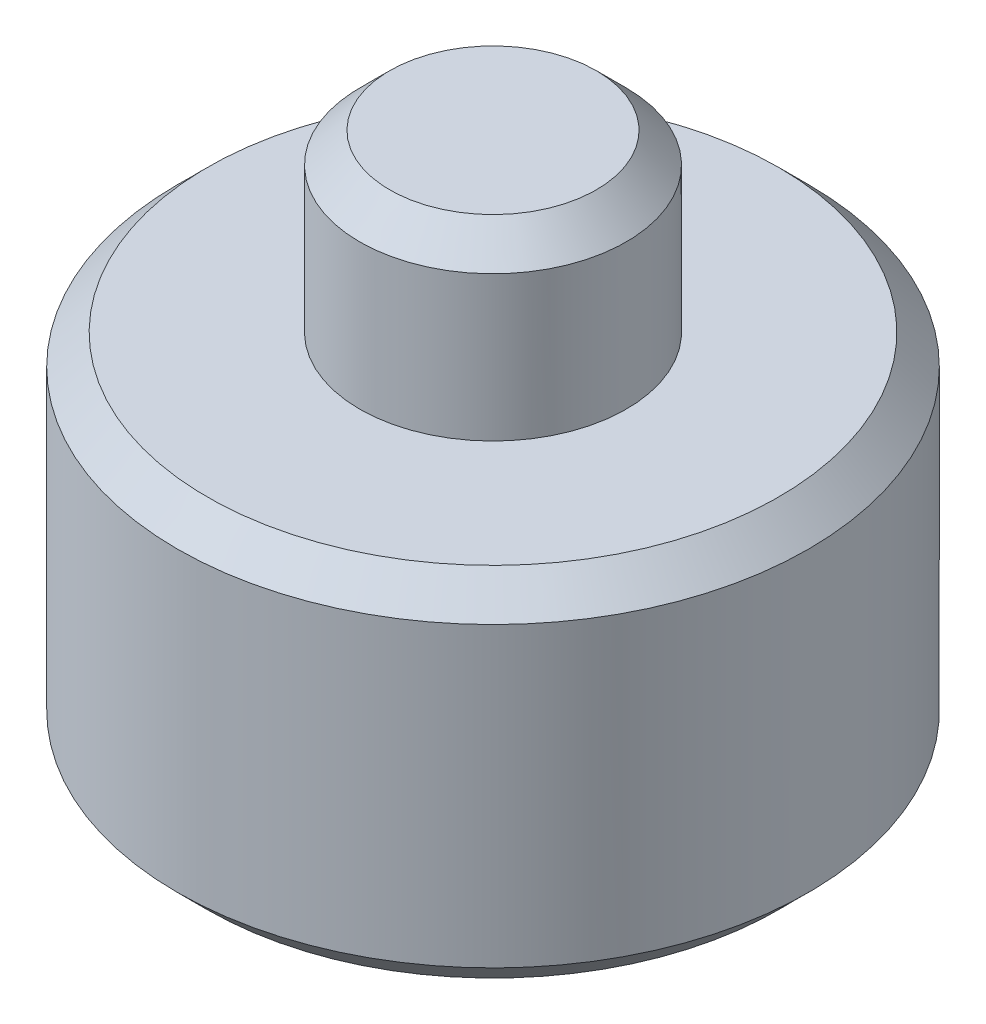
ISO-10303-21;
HEADER;
FILE_DESCRIPTION(('STEP AP214'),'2;1');
FILE_NAME('part.step','',(''),(''),'','','');
FILE_SCHEMA(('AUTOMOTIVE_DESIGN { 1 0 10303 214 1 1 1 1 }'));
ENDSEC;
DATA;
#1=APPLICATION_CONTEXT('core data for automotive mechanical design processes');
#2=APPLICATION_PROTOCOL_DEFINITION('international standard','automotive_design',2000,#1);
#3=PRODUCT_CONTEXT('',#1,'mechanical');
#4=PRODUCT('Part','Part','',(#3));
#5=PRODUCT_RELATED_PRODUCT_CATEGORY('part','',(#4));
#6=PRODUCT_DEFINITION_FORMATION('','',#4);
#7=PRODUCT_DEFINITION_CONTEXT('part definition',#1,'design');
#8=PRODUCT_DEFINITION('design','',#6,#7);
#9=PRODUCT_DEFINITION_SHAPE('','',#8);
#10=(LENGTH_UNIT() NAMED_UNIT(*) SI_UNIT(.MILLI.,.METRE.));
#11=(NAMED_UNIT(*) PLANE_ANGLE_UNIT() SI_UNIT($,.RADIAN.));
#12=(NAMED_UNIT(*) SI_UNIT($,.STERADIAN.) SOLID_ANGLE_UNIT());
#13=UNCERTAINTY_MEASURE_WITH_UNIT(LENGTH_MEASURE(1.E-05),#10,'distance_accuracy_value','');
#14=(GEOMETRIC_REPRESENTATION_CONTEXT(3) GLOBAL_UNCERTAINTY_ASSIGNED_CONTEXT((#13)) GLOBAL_UNIT_ASSIGNED_CONTEXT((#10,
#11,#12)) REPRESENTATION_CONTEXT('',''));
#15=CARTESIAN_POINT('',(0.,0.,0.));
#16=DIRECTION('',(0.,0.,1.));
#17=DIRECTION('',(1.,0.,0.));
#18=AXIS2_PLACEMENT_3D('',#15,#16,#17);
#19=CARTESIAN_POINT('',(0.,-5.,0.));
#20=DIRECTION('',(0.,1.,0.));
#21=DIRECTION('',(0.,0.,1.));
#22=AXIS2_PLACEMENT_3D('',#19,#20,#21);
#23=PLANE('',#22);
#24=CARTESIAN_POINT('',(0.,-5.,0.));
#25=DIRECTION('',(0.,1.,0.));
#26=DIRECTION('',(0.,0.,1.));
#27=AXIS2_PLACEMENT_3D('',#24,#25,#26);
#28=CIRCLE('',#27,28.538879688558);
#29=CARTESIAN_POINT('',(0.,-5.,28.538879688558));
#30=VERTEX_POINT('',#29);
#31=EDGE_CURVE('E47',#30,#30,#28,.F.);
#32=ORIENTED_EDGE('',*,*,#31,.T.);
#33=EDGE_LOOP('',(#32));
#34=FACE_BOUND('',#33,.T.);
#35=ADVANCED_FACE('F32',(#34),#23,.F.);
#36=CARTESIAN_POINT('',(0.,48.1925520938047,0.));
#37=DIRECTION('',(0.,1.,0.));
#38=DIRECTION('',(0.,0.,1.));
#39=AXIS2_PLACEMENT_3D('',#36,#37,#38);
#40=CYLINDRICAL_SURFACE('',#39,31.538879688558);
#41=CARTESIAN_POINT('',(0.,-1.99999999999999,0.));
#42=DIRECTION('',(0.,1.,0.));
#43=DIRECTION('',(0.,0.,1.));
#44=AXIS2_PLACEMENT_3D('',#41,#42,#43);
#45=CIRCLE('',#44,31.538879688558);
#46=CARTESIAN_POINT('',(0.,-1.99999999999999,31.538879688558));
#47=VERTEX_POINT('',#46);
#48=EDGE_CURVE('E52',#47,#47,#45,.T.);
#49=ORIENTED_EDGE('',*,*,#48,.T.);
#50=EDGE_LOOP('',(#49));
#51=FACE_BOUND('',#50,.T.);
#52=CARTESIAN_POINT('',(0.,27.7156214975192,0.));
#53=DIRECTION('',(0.,-1.,0.));
#54=DIRECTION('',(0.,0.,-1.));
#55=AXIS2_PLACEMENT_3D('',#52,#53,#54);
#56=CIRCLE('',#55,31.538879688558);
#57=CARTESIAN_POINT('',(0.,27.7156214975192,-31.538879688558));
#58=VERTEX_POINT('',#57);
#59=EDGE_CURVE('E55',#58,#58,#56,.T.);
#60=ORIENTED_EDGE('',*,*,#59,.T.);
#61=EDGE_LOOP('',(#60));
#62=FACE_BOUND('',#61,.T.);
#63=ADVANCED_FACE('F66',(#51,#62),#40,.T.);
#64=CARTESIAN_POINT('',(21.538879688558,30.7156214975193,0.));
#65=DIRECTION('',(0.,-1.,0.));
#66=DIRECTION('',(0.,0.,-1.));
#67=AXIS2_PLACEMENT_3D('',#64,#65,#66);
#68=PLANE('',#67);
#69=CARTESIAN_POINT('',(0.,30.7156214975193,0.));
#70=DIRECTION('',(0.,-1.,0.));
#71=DIRECTION('',(0.,0.,-1.));
#72=AXIS2_PLACEMENT_3D('',#69,#70,#71);
#73=CIRCLE('',#72,28.538879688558);
#74=CARTESIAN_POINT('',(0.,30.7156214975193,-28.538879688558));
#75=VERTEX_POINT('',#74);
#76=EDGE_CURVE('E43',#75,#75,#73,.F.);
#77=ORIENTED_EDGE('',*,*,#76,.T.);
#78=EDGE_LOOP('',(#77));
#79=FACE_BOUND('',#78,.T.);
#80=CARTESIAN_POINT('',(0.,30.7156214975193,0.));
#81=DIRECTION('',(0.,1.,0.));
#82=DIRECTION('',(0.,0.,1.));
#83=AXIS2_PLACEMENT_3D('',#80,#81,#82);
#84=CIRCLE('',#83,13.323228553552);
#85=CARTESIAN_POINT('',(0.,30.7156214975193,13.323228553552));
#86=VERTEX_POINT('',#85);
#87=EDGE_CURVE('E58',#86,#86,#84,.T.);
#88=ORIENTED_EDGE('',*,*,#87,.F.);
#89=EDGE_LOOP('',(#88));
#90=FACE_BOUND('',#89,.T.);
#91=ADVANCED_FACE('F64',(#79,#90),#68,.F.);
#92=CARTESIAN_POINT('',(0.,48.1925520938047,0.));
#93=DIRECTION('',(0.,1.,0.));
#94=DIRECTION('',(0.,0.,1.));
#95=AXIS2_PLACEMENT_3D('',#92,#93,#94);
#96=CYLINDRICAL_SURFACE('',#95,13.323228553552);
#97=CARTESIAN_POINT('',(0.,45.1925520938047,0.));
#98=DIRECTION('',(0.,-1.,0.));
#99=DIRECTION('',(0.,0.,-1.));
#100=AXIS2_PLACEMENT_3D('',#97,#98,#99);
#101=CIRCLE('',#100,13.323228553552);
#102=CARTESIAN_POINT('',(0.,45.1925520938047,-13.323228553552));
#103=VERTEX_POINT('',#102);
#104=EDGE_CURVE('E11',#103,#103,#101,.T.);
#105=ORIENTED_EDGE('',*,*,#104,.T.);
#106=EDGE_LOOP('',(#105));
#107=FACE_BOUND('',#106,.T.);
#108=ORIENTED_EDGE('',*,*,#87,.T.);
#109=EDGE_LOOP('',(#108));
#110=FACE_BOUND('',#109,.T.);
#111=ADVANCED_FACE('F62',(#107,#110),#96,.T.);
#112=CARTESIAN_POINT('',(13.323228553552,48.1925520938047,0.));
#113=DIRECTION('',(0.,-1.,0.));
#114=DIRECTION('',(0.,0.,-1.));
#115=AXIS2_PLACEMENT_3D('',#112,#113,#114);
#116=PLANE('',#115);
#117=CARTESIAN_POINT('',(0.,48.1925520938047,0.));
#118=DIRECTION('',(0.,-1.,0.));
#119=DIRECTION('',(0.,0.,-1.));
#120=AXIS2_PLACEMENT_3D('',#117,#118,#119);
#121=CIRCLE('',#120,10.323228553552);
#122=CARTESIAN_POINT('',(0.,48.1925520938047,-10.323228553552));
#123=VERTEX_POINT('',#122);
#124=EDGE_CURVE('E39',#123,#123,#121,.F.);
#125=ORIENTED_EDGE('',*,*,#124,.T.);
#126=EDGE_LOOP('',(#125));
#127=FACE_BOUND('',#126,.T.);
#128=ADVANCED_FACE('F73',(#127),#116,.F.);
#129=CARTESIAN_POINT('',(0.,-1.99999999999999,0.));
#130=DIRECTION('',(0.,1.,0.));
#131=DIRECTION('',(0.,0.,1.));
#132=AXIS2_PLACEMENT_3D('',#129,#130,#131);
#133=CONICAL_SURFACE('',#132,31.538879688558,0.785398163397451);
#134=ORIENTED_EDGE('',*,*,#31,.F.);
#135=EDGE_LOOP('',(#134));
#136=FACE_BOUND('',#135,.T.);
#137=ORIENTED_EDGE('',*,*,#48,.F.);
#138=EDGE_LOOP('',(#137));
#139=FACE_BOUND('',#138,.T.);
#140=ADVANCED_FACE('F83',(#136,#139),#133,.T.);
#141=CARTESIAN_POINT('',(0.,30.7156214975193,0.));
#142=DIRECTION('',(0.,-1.,0.));
#143=DIRECTION('',(0.,0.,-1.));
#144=AXIS2_PLACEMENT_3D('',#141,#142,#143);
#145=CONICAL_SURFACE('',#144,28.538879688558,0.785398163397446);
#146=CARTESIAN_POINT('',(0.,27.7156214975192,-31.538879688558));
#147=CARTESIAN_POINT('',(0.,27.7468714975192,-31.507629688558));
#148=CARTESIAN_POINT('',(0.,27.7781214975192,-31.476379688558));
#149=CARTESIAN_POINT('',(0.,27.8406214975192,-31.413879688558));
#150=CARTESIAN_POINT('',(0.,27.8718714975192,-31.382629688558));
#151=CARTESIAN_POINT('',(0.,27.9343714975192,-31.320129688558));
#152=CARTESIAN_POINT('',(0.,27.9656214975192,-31.288879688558));
#153=CARTESIAN_POINT('',(0.,28.0281214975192,-31.226379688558));
#154=CARTESIAN_POINT('',(0.,28.0593714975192,-31.195129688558));
#155=CARTESIAN_POINT('',(0.,28.1218714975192,-31.132629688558));
#156=CARTESIAN_POINT('',(0.,28.1531214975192,-31.101379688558));
#157=CARTESIAN_POINT('',(0.,28.2156214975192,-31.038879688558));
#158=CARTESIAN_POINT('',(0.,28.2468714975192,-31.007629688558));
#159=CARTESIAN_POINT('',(0.,28.3093714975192,-30.945129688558));
#160=CARTESIAN_POINT('',(0.,28.3406214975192,-30.913879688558));
#161=CARTESIAN_POINT('',(0.,28.4031214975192,-30.851379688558));
#162=CARTESIAN_POINT('',(0.,28.4343714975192,-30.820129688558));
#163=CARTESIAN_POINT('',(0.,28.4968714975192,-30.757629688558));
#164=CARTESIAN_POINT('',(0.,28.5281214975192,-30.726379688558));
#165=CARTESIAN_POINT('',(0.,28.5906214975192,-30.663879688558));
#166=CARTESIAN_POINT('',(0.,28.6218714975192,-30.632629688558));
#167=CARTESIAN_POINT('',(0.,28.6843714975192,-30.570129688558));
#168=CARTESIAN_POINT('',(0.,28.7156214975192,-30.538879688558));
#169=CARTESIAN_POINT('',(0.,28.7781214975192,-30.476379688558));
#170=CARTESIAN_POINT('',(0.,28.8093714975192,-30.445129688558));
#171=CARTESIAN_POINT('',(0.,28.8718714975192,-30.382629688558));
#172=CARTESIAN_POINT('',(0.,28.9031214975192,-30.351379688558));
#173=CARTESIAN_POINT('',(0.,28.9656214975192,-30.288879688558));
#174=CARTESIAN_POINT('',(0.,28.9968714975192,-30.257629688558));
#175=CARTESIAN_POINT('',(0.,29.0593714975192,-30.195129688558));
#176=CARTESIAN_POINT('',(0.,29.0906214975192,-30.163879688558));
#177=CARTESIAN_POINT('',(0.,29.1531214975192,-30.101379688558));
#178=CARTESIAN_POINT('',(0.,29.1843714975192,-30.070129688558));
#179=CARTESIAN_POINT('',(0.,29.2468714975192,-30.007629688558));
#180=CARTESIAN_POINT('',(0.,29.2781214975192,-29.976379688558));
#181=CARTESIAN_POINT('',(0.,29.3406214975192,-29.913879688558));
#182=CARTESIAN_POINT('',(0.,29.3718714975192,-29.882629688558));
#183=CARTESIAN_POINT('',(0.,29.4343714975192,-29.820129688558));
#184=CARTESIAN_POINT('',(0.,29.4656214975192,-29.788879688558));
#185=CARTESIAN_POINT('',(0.,29.5281214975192,-29.726379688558));
#186=CARTESIAN_POINT('',(0.,29.5593714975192,-29.695129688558));
#187=CARTESIAN_POINT('',(0.,29.6218714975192,-29.632629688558));
#188=CARTESIAN_POINT('',(0.,29.6531214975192,-29.601379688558));
#189=CARTESIAN_POINT('',(0.,29.7156214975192,-29.538879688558));
#190=CARTESIAN_POINT('',(0.,29.7468714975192,-29.507629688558));
#191=CARTESIAN_POINT('',(0.,29.8093714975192,-29.445129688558));
#192=CARTESIAN_POINT('',(0.,29.8406214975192,-29.413879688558));
#193=CARTESIAN_POINT('',(0.,29.9031214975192,-29.351379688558));
#194=CARTESIAN_POINT('',(0.,29.9343714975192,-29.320129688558));
#195=CARTESIAN_POINT('',(0.,29.9968714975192,-29.257629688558));
#196=CARTESIAN_POINT('',(0.,30.0281214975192,-29.226379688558));
#197=CARTESIAN_POINT('',(0.,30.0906214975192,-29.163879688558));
#198=CARTESIAN_POINT('',(0.,30.1218714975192,-29.132629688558));
#199=CARTESIAN_POINT('',(0.,30.1843714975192,-29.070129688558));
#200=CARTESIAN_POINT('',(0.,30.2156214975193,-29.038879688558));
#201=CARTESIAN_POINT('',(0.,30.2781214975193,-28.976379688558));
#202=CARTESIAN_POINT('',(0.,30.3093714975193,-28.945129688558));
#203=CARTESIAN_POINT('',(0.,30.3718714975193,-28.882629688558));
#204=CARTESIAN_POINT('',(0.,30.4031214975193,-28.851379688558));
#205=CARTESIAN_POINT('',(0.,30.4656214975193,-28.788879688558));
#206=CARTESIAN_POINT('',(0.,30.4968714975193,-28.757629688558));
#207=CARTESIAN_POINT('',(0.,30.5593714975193,-28.695129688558));
#208=CARTESIAN_POINT('',(0.,30.5906214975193,-28.663879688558));
#209=CARTESIAN_POINT('',(0.,30.6531214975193,-28.601379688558));
#210=CARTESIAN_POINT('',(0.,30.6843714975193,-28.570129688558));
#211=CARTESIAN_POINT('',(0.,30.7156214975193,-28.538879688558));
#212=B_SPLINE_CURVE_WITH_KNOTS('',3,(#146,#147,#148,#149,#150,#151,#152,#153,#154,#155,#156,
#157,#158,#159,#160,#161,#162,#163,#164,#165,#166,#167,#168,#169,#170,#171,#172,#173,#174,#175,
#176,#177,#178,#179,#180,#181,#182,#183,#184,#185,#186,#187,#188,#189,#190,#191,#192,#193,#194,
#195,#196,#197,#198,#199,#200,#201,#202,#203,#204,#205,#206,#207,#208,#209,#210,#211),
.UNSPECIFIED.,.F.,.F.,(4,2,2,2,2,2,2,2,2,2,2,2,2,2,2,2,2,2,2,2,2,2,2,2,2,2,2,2,2,2,2,2,4),(0.,
0.132582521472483,0.265165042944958,0.397747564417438,0.530330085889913,0.662912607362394,
0.795495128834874,0.928077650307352,1.06066017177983,1.19324269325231,1.32582521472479,
1.45840773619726,1.59099025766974,1.72357277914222,1.8561553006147,1.98873782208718,
2.12132034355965,2.25390286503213,2.38648538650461,2.51906790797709,2.65165042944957,
2.78423295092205,2.91681547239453,3.04939799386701,3.18198051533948,3.31456303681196,
3.44714555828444,3.57972807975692,3.7123106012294,3.84489312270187,3.97747564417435,
4.11005816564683,4.24264068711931),.UNSPECIFIED.);
#213=EDGE_CURVE('BSEAM85',#58,#75,#212,.T.);
#214=ORIENTED_EDGE('',*,*,#59,.F.);
#215=ORIENTED_EDGE('',*,*,#76,.F.);
#216=ORIENTED_EDGE('',*,*,#213,.T.);
#217=ORIENTED_EDGE('',*,*,#213,.F.);
#218=EDGE_LOOP('',(#214,#216,#215,#217));
#219=FACE_BOUND('',#218,.T.);
#220=ADVANCED_FACE('F85',(#219),#145,.T.);
#221=CARTESIAN_POINT('',(0.,48.1925520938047,0.));
#222=DIRECTION('',(0.,-1.,0.));
#223=DIRECTION('',(0.,0.,-1.));
#224=AXIS2_PLACEMENT_3D('',#221,#222,#223);
#225=CONICAL_SURFACE('',#224,10.323228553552,0.785398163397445);
#226=ORIENTED_EDGE('',*,*,#104,.F.);
#227=EDGE_LOOP('',(#226));
#228=FACE_BOUND('',#227,.T.);
#229=ORIENTED_EDGE('',*,*,#124,.F.);
#230=EDGE_LOOP('',(#229));
#231=FACE_BOUND('',#230,.T.);
#232=ADVANCED_FACE('F34',(#228,#231),#225,.T.);
#233=CLOSED_SHELL('',(#35,#63,#91,#111,#128,#140,#220,#232));
#234=MANIFOLD_SOLID_BREP('B2',#233);
#235=ADVANCED_BREP_SHAPE_REPRESENTATION('',(#18,#234),#14);
#236=SHAPE_DEFINITION_REPRESENTATION(#9,#235);
ENDSEC;
END-ISO-10303-21;
